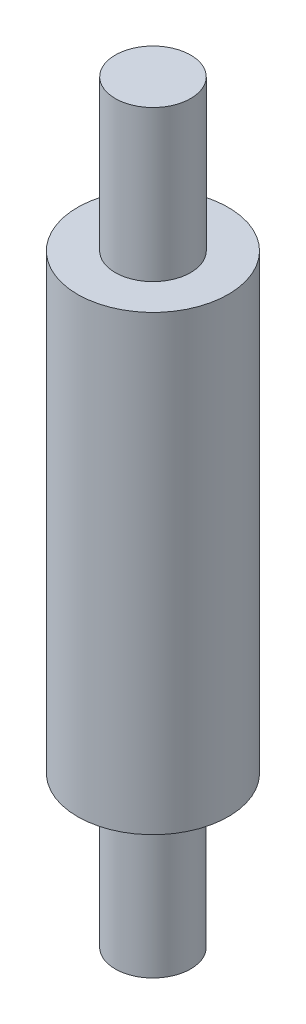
ISO-10303-21;
HEADER;
FILE_DESCRIPTION(('STEP AP214'),'2;1');
FILE_NAME('part.step','',(''),(''),'','','');
FILE_SCHEMA(('AUTOMOTIVE_DESIGN { 1 0 10303 214 1 1 1 1 }'));
ENDSEC;
DATA;
#1=APPLICATION_CONTEXT('core data for automotive mechanical design processes');
#2=APPLICATION_PROTOCOL_DEFINITION('international standard','automotive_design',2000,#1);
#3=PRODUCT_CONTEXT('',#1,'mechanical');
#4=PRODUCT('Part','Part','',(#3));
#5=PRODUCT_RELATED_PRODUCT_CATEGORY('part','',(#4));
#6=PRODUCT_DEFINITION_FORMATION('','',#4);
#7=PRODUCT_DEFINITION_CONTEXT('part definition',#1,'design');
#8=PRODUCT_DEFINITION('design','',#6,#7);
#9=PRODUCT_DEFINITION_SHAPE('','',#8);
#10=(LENGTH_UNIT() NAMED_UNIT(*) SI_UNIT(.MILLI.,.METRE.));
#11=(NAMED_UNIT(*) PLANE_ANGLE_UNIT() SI_UNIT($,.RADIAN.));
#12=(NAMED_UNIT(*) SI_UNIT($,.STERADIAN.) SOLID_ANGLE_UNIT());
#13=UNCERTAINTY_MEASURE_WITH_UNIT(LENGTH_MEASURE(1.E-05),#10,'distance_accuracy_value','');
#14=(GEOMETRIC_REPRESENTATION_CONTEXT(3) GLOBAL_UNCERTAINTY_ASSIGNED_CONTEXT((#13)) GLOBAL_UNIT_ASSIGNED_CONTEXT((#10,
#11,#12)) REPRESENTATION_CONTEXT('',''));
#15=CARTESIAN_POINT('',(0.,0.,0.));
#16=DIRECTION('',(0.,0.,1.));
#17=DIRECTION('',(1.,0.,0.));
#18=AXIS2_PLACEMENT_3D('',#15,#16,#17);
#19=CARTESIAN_POINT('',(0.,0.,0.));
#20=DIRECTION('',(0.,1.,0.));
#21=DIRECTION('',(0.,0.,1.));
#22=AXIS2_PLACEMENT_3D('',#19,#20,#21);
#23=PLANE('',#22);
#24=CARTESIAN_POINT('',(0.,0.,0.));
#25=DIRECTION('',(0.,1.,0.));
#26=DIRECTION('',(0.,0.,1.));
#27=AXIS2_PLACEMENT_3D('',#24,#25,#26);
#28=CIRCLE('',#27,3.);
#29=CARTESIAN_POINT('',(0.,0.,3.));
#30=VERTEX_POINT('',#29);
#31=EDGE_CURVE('E39',#30,#30,#28,.T.);
#32=ORIENTED_EDGE('',*,*,#31,.F.);
#33=EDGE_LOOP('',(#32));
#34=FACE_BOUND('',#33,.T.);
#35=CARTESIAN_POINT('',(0.,0.,0.));
#36=DIRECTION('',(0.,1.,0.));
#37=DIRECTION('',(0.,0.,1.));
#38=AXIS2_PLACEMENT_3D('',#35,#36,#37);
#39=CIRCLE('',#38,1.5);
#40=CARTESIAN_POINT('',(0.,0.,1.5));
#41=VERTEX_POINT('',#40);
#42=EDGE_CURVE('E10',#41,#41,#39,.F.);
#43=ORIENTED_EDGE('',*,*,#42,.F.);
#44=EDGE_LOOP('',(#43));
#45=FACE_BOUND('',#44,.T.);
#46=ADVANCED_FACE('F28',(#34,#45),#23,.F.);
#47=CARTESIAN_POINT('',(0.,18.,0.));
#48=DIRECTION('',(0.,1.,0.));
#49=DIRECTION('',(0.,0.,1.));
#50=AXIS2_PLACEMENT_3D('',#47,#48,#49);
#51=PLANE('',#50);
#52=CARTESIAN_POINT('',(0.,18.,0.));
#53=DIRECTION('',(0.,1.,0.));
#54=DIRECTION('',(0.,0.,1.));
#55=AXIS2_PLACEMENT_3D('',#52,#53,#54);
#56=CIRCLE('',#55,3.);
#57=CARTESIAN_POINT('',(0.,18.,3.));
#58=VERTEX_POINT('',#57);
#59=EDGE_CURVE('E35',#58,#58,#56,.T.);
#60=ORIENTED_EDGE('',*,*,#59,.T.);
#61=EDGE_LOOP('',(#60));
#62=FACE_BOUND('',#61,.T.);
#63=CARTESIAN_POINT('',(0.,18.,0.));
#64=DIRECTION('',(0.,1.,0.));
#65=DIRECTION('',(0.,0.,1.));
#66=AXIS2_PLACEMENT_3D('',#63,#64,#65);
#67=CIRCLE('',#66,1.5);
#68=CARTESIAN_POINT('',(0.,18.,1.5));
#69=VERTEX_POINT('',#68);
#70=EDGE_CURVE('E48',#69,#69,#67,.T.);
#71=ORIENTED_EDGE('',*,*,#70,.F.);
#72=EDGE_LOOP('',(#71));
#73=FACE_BOUND('',#72,.T.);
#74=ADVANCED_FACE('F70',(#62,#73),#51,.T.);
#75=CARTESIAN_POINT('',(0.,18.,0.));
#76=DIRECTION('',(0.,-1.,0.));
#77=DIRECTION('',(0.,0.,-1.));
#78=AXIS2_PLACEMENT_3D('',#75,#76,#77);
#79=CYLINDRICAL_SURFACE('',#78,3.);
#80=ORIENTED_EDGE('',*,*,#59,.F.);
#81=EDGE_LOOP('',(#80));
#82=FACE_BOUND('',#81,.T.);
#83=ORIENTED_EDGE('',*,*,#31,.T.);
#84=EDGE_LOOP('',(#83));
#85=FACE_BOUND('',#84,.T.);
#86=ADVANCED_FACE('F30',(#82,#85),#79,.T.);
#87=CARTESIAN_POINT('',(0.,24.,0.));
#88=DIRECTION('',(0.,-1.,0.));
#89=DIRECTION('',(0.,0.,-1.));
#90=AXIS2_PLACEMENT_3D('',#87,#88,#89);
#91=CYLINDRICAL_SURFACE('',#90,1.5);
#92=CARTESIAN_POINT('',(0.,24.,0.));
#93=DIRECTION('',(0.,1.,0.));
#94=DIRECTION('',(0.,0.,1.));
#95=AXIS2_PLACEMENT_3D('',#92,#93,#94);
#96=CIRCLE('',#95,1.5);
#97=CARTESIAN_POINT('',(0.,24.,1.5));
#98=VERTEX_POINT('',#97);
#99=EDGE_CURVE('E43',#98,#98,#96,.T.);
#100=ORIENTED_EDGE('',*,*,#99,.F.);
#101=EDGE_LOOP('',(#100));
#102=FACE_BOUND('',#101,.T.);
#103=ORIENTED_EDGE('',*,*,#70,.T.);
#104=EDGE_LOOP('',(#103));
#105=FACE_BOUND('',#104,.T.);
#106=ADVANCED_FACE('F66',(#102,#105),#91,.T.);
#107=CARTESIAN_POINT('',(0.,24.,0.));
#108=DIRECTION('',(0.,1.,0.));
#109=DIRECTION('',(0.,0.,1.));
#110=AXIS2_PLACEMENT_3D('',#107,#108,#109);
#111=PLANE('',#110);
#112=ORIENTED_EDGE('',*,*,#99,.T.);
#113=EDGE_LOOP('',(#112));
#114=FACE_BOUND('',#113,.T.);
#115=ADVANCED_FACE('F59',(#114),#111,.T.);
#116=CARTESIAN_POINT('',(0.,-6.,0.));
#117=DIRECTION('',(0.,1.,0.));
#118=DIRECTION('',(0.,0.,1.));
#119=AXIS2_PLACEMENT_3D('',#116,#117,#118);
#120=CYLINDRICAL_SURFACE('',#119,1.5);
#121=CARTESIAN_POINT('',(0.,-6.,0.));
#122=DIRECTION('',(0.,-1.,0.));
#123=DIRECTION('',(0.,0.,-1.));
#124=AXIS2_PLACEMENT_3D('',#121,#122,#123);
#125=CIRCLE('',#124,1.5);
#126=CARTESIAN_POINT('',(0.,-6.,-1.5));
#127=VERTEX_POINT('',#126);
#128=EDGE_CURVE('E51',#127,#127,#125,.T.);
#129=ORIENTED_EDGE('',*,*,#128,.F.);
#130=EDGE_LOOP('',(#129));
#131=FACE_BOUND('',#130,.T.);
#132=ORIENTED_EDGE('',*,*,#42,.T.);
#133=EDGE_LOOP('',(#132));
#134=FACE_BOUND('',#133,.T.);
#135=ADVANCED_FACE('F57',(#131,#134),#120,.T.);
#136=CARTESIAN_POINT('',(0.,-6.,0.));
#137=DIRECTION('',(0.,-1.,0.));
#138=DIRECTION('',(0.,0.,-1.));
#139=AXIS2_PLACEMENT_3D('',#136,#137,#138);
#140=PLANE('',#139);
#141=ORIENTED_EDGE('',*,*,#128,.T.);
#142=EDGE_LOOP('',(#141));
#143=FACE_BOUND('',#142,.T.);
#144=ADVANCED_FACE('F55',(#143),#140,.T.);
#145=CLOSED_SHELL('',(#46,#74,#86,#106,#115,#135,#144));
#146=MANIFOLD_SOLID_BREP('B2',#145);
#147=ADVANCED_BREP_SHAPE_REPRESENTATION('',(#18,#146),#14);
#148=SHAPE_DEFINITION_REPRESENTATION(#9,#147);
ENDSEC;
END-ISO-10303-21;
